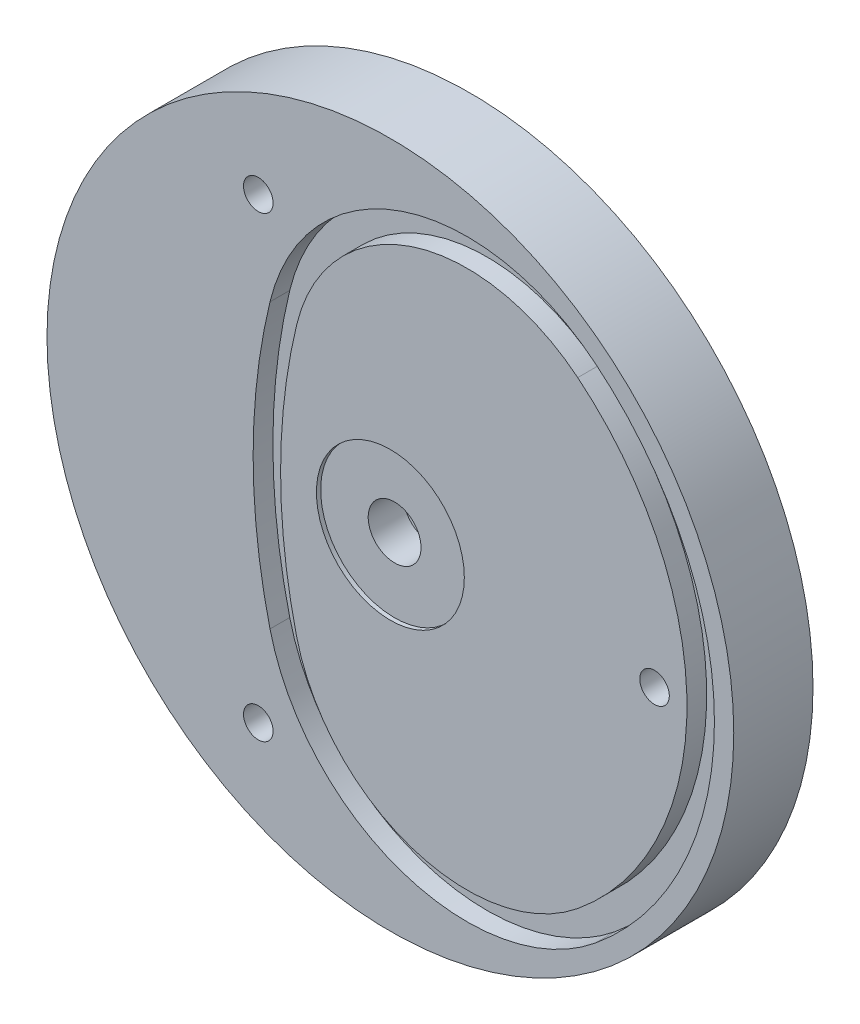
from build123d import *

# Parameters (mm, degrees)
SKETCH1_R          = 82.55
BASE_EXTRUDE_DEPTH = 19.05
SKETCH2_R          = 17.78
CUT_EXTRUDE1_DEPTH = 1.016
SKETCH4_R          = 10.16
CUT_EXTRUDE2_DEPTH = 9.525
SKETCH5_R          = 6.35
CUT_EXTRUDE3_DEPTH = 119.128024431
SKETCH13_R         = 3.556
CUT_EXTRUDE4_DEPTH = 119.287393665
CIRPATTERN1_COUNT  = 3
SKETCH20_W         = 6.604
SKETCH20_H         = 4.7498


with BuildPart() as part:
    # Sketch1 → Base-Extrude (new body)
    with BuildSketch(Plane.XY):
        with Locations(Location((0, 0, 0), (0, 0, 180))):
            Circle(SKETCH1_R)
    extrude(amount=BASE_EXTRUDE_DEPTH)

    # Sketch2 → Cut-Extrude1 (cut)
    with BuildSketch(Plane.XY.offset(19.05)):
        Circle(SKETCH2_R)
    extrude(amount=-CUT_EXTRUDE1_DEPTH, mode=Mode.SUBTRACT)

    # Sketch4 → Cut-Extrude2 (cut)
    with BuildSketch(Plane(origin=(0, 0, 0), x_dir=(-1, 0, 0), z_dir=(0, 0, -1))):
        Circle(SKETCH4_R)
    extrude(amount=-CUT_EXTRUDE2_DEPTH, mode=Mode.SUBTRACT)

    # Sketch5 → Cut-Extrude3 (cut, through all)
    with BuildSketch(Plane.XY.offset(18.034)):
        Circle(SKETCH5_R)
    extrude(amount=-CUT_EXTRUDE3_DEPTH, mode=Mode.SUBTRACT)

    # Sketch13 → Cut-Extrude4 (cut, through all)
    with BuildSketch(Plane.XY.offset(19.05)):
        with Locations((63.5, 0)):
            Circle(SKETCH13_R)
    cut_extrude4 = extrude(amount=-CUT_EXTRUDE4_DEPTH, mode=Mode.SUBTRACT)

    # CirPattern1: Cut-Extrude4 ×3 about axis
    cirpattern1_axis = Axis((0, 0, 0), (0, 0, -1))
    for i in range(1, CIRPATTERN1_COUNT):
        add(cut_extrude4.rotate(cirpattern1_axis, i * 360 / CIRPATTERN1_COUNT), mode=Mode.SUBTRACT)

    # Cut-Sweep1: sweep along a path in Sketch19
    with BuildLine(Plane.XY.offset(19.05)) as cut_sweep1_path:
        ThreePointArc((74.5998, 0), (67.383527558, 32.009223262), (47.130815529, 57.825741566))
        ThreePointArc((47.130815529, 57.825741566), (3.924430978, 65.663019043), (-25.730473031, 33.27781791))
        ThreePointArc((-25.730473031, 33.27781791), (-28.69858253, 16.756428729), (-29.6926, 0))
    # Sketch20 → Cut-Sweep1 (sweep, cut)
    with BuildSketch(Plane(origin=(0, 0, 0), x_dir=(1, 0, 0), z_dir=(0, 1, 0))):
        with Locations((74.5998, -16.6751)):
            Rectangle(SKETCH20_W, SKETCH20_H)
    cut_sweep1 = sweep(path=cut_sweep1_path.line, mode=Mode.SUBTRACT)

    # Mirror1: Cut-Sweep1 across plane
    add(cut_sweep1.mirror(Plane.ZX), mode=Mode.SUBTRACT)


solid = part.part
